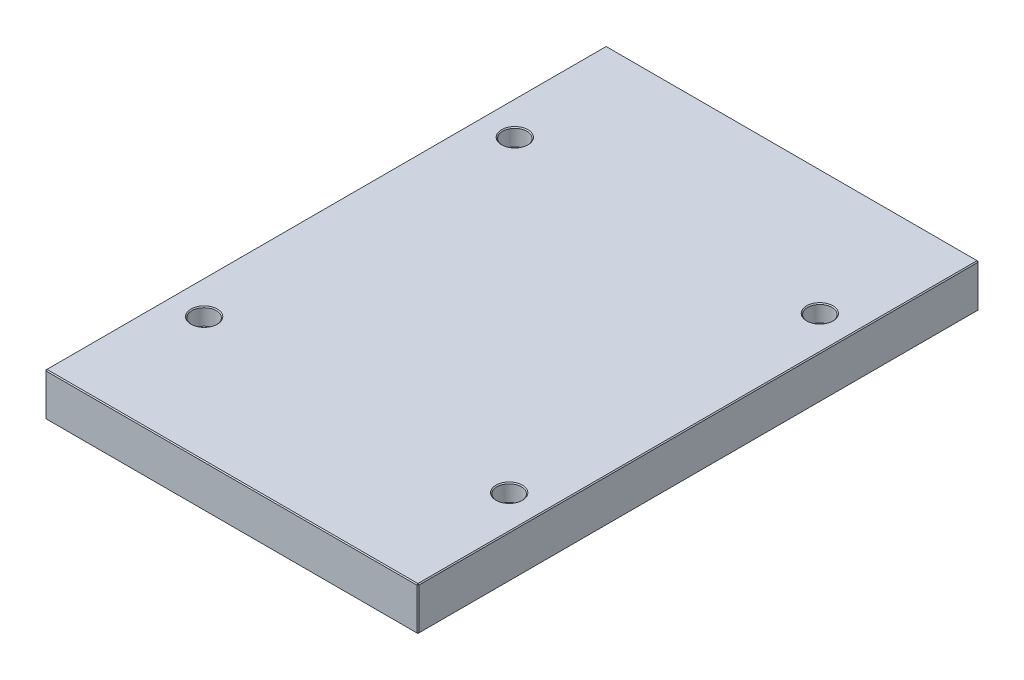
ISO-10303-21;
HEADER;
FILE_DESCRIPTION(('STEP AP214'),'2;1');
FILE_NAME('part.step','',(''),(''),'','','');
FILE_SCHEMA(('AUTOMOTIVE_DESIGN { 1 0 10303 214 1 1 1 1 }'));
ENDSEC;
DATA;
#1=APPLICATION_CONTEXT('core data for automotive mechanical design processes');
#2=APPLICATION_PROTOCOL_DEFINITION('international standard','automotive_design',2000,#1);
#3=PRODUCT_CONTEXT('',#1,'mechanical');
#4=PRODUCT('Part','Part','',(#3));
#5=PRODUCT_RELATED_PRODUCT_CATEGORY('part','',(#4));
#6=PRODUCT_DEFINITION_FORMATION('','',#4);
#7=PRODUCT_DEFINITION_CONTEXT('part definition',#1,'design');
#8=PRODUCT_DEFINITION('design','',#6,#7);
#9=PRODUCT_DEFINITION_SHAPE('','',#8);
#10=(LENGTH_UNIT() NAMED_UNIT(*) SI_UNIT(.MILLI.,.METRE.));
#11=(NAMED_UNIT(*) PLANE_ANGLE_UNIT() SI_UNIT($,.RADIAN.));
#12=(NAMED_UNIT(*) SI_UNIT($,.STERADIAN.) SOLID_ANGLE_UNIT());
#13=UNCERTAINTY_MEASURE_WITH_UNIT(LENGTH_MEASURE(1.E-05),#10,'distance_accuracy_value','');
#14=(GEOMETRIC_REPRESENTATION_CONTEXT(3) GLOBAL_UNCERTAINTY_ASSIGNED_CONTEXT((#13)) GLOBAL_UNIT_ASSIGNED_CONTEXT((#10,
#11,#12)) REPRESENTATION_CONTEXT('',''));
#15=CARTESIAN_POINT('',(0.,0.,0.));
#16=DIRECTION('',(0.,0.,1.));
#17=DIRECTION('',(1.,0.,0.));
#18=AXIS2_PLACEMENT_3D('',#15,#16,#17);
#19=CARTESIAN_POINT('',(-198.,46.,298.));
#20=DIRECTION('',(1.,0.,0.));
#21=DIRECTION('',(0.,0.,-1.));
#22=AXIS2_PLACEMENT_3D('',#19,#20,#21);
#23=PLANE('',#22);
#24=DIRECTION('',(0.,-1.,0.));
#25=VECTOR('',#24,1.);
#26=CARTESIAN_POINT('',(-198.,46.,-297.));
#27=LINE('',#26,#25);
#28=CARTESIAN_POINT('',(-198.,45.,-297.));
#29=VERTEX_POINT('',#28);
#30=CARTESIAN_POINT('',(-198.,1.00000000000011,-297.));
#31=VERTEX_POINT('',#30);
#32=EDGE_CURVE('E115',#29,#31,#27,.T.);
#33=ORIENTED_EDGE('',*,*,#32,.T.);
#34=DIRECTION('',(0.,0.,1.));
#35=VECTOR('',#34,1.);
#36=CARTESIAN_POINT('',(-198.,1.00000000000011,298.));
#37=LINE('',#36,#35);
#38=CARTESIAN_POINT('',(-198.,1.00000000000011,297.));
#39=VERTEX_POINT('',#38);
#40=EDGE_CURVE('E111',#31,#39,#37,.T.);
#41=ORIENTED_EDGE('',*,*,#40,.T.);
#42=DIRECTION('',(0.,1.,0.));
#43=VECTOR('',#42,1.);
#44=CARTESIAN_POINT('',(-198.,46.,297.));
#45=LINE('',#44,#43);
#46=CARTESIAN_POINT('',(-198.,45.,297.));
#47=VERTEX_POINT('',#46);
#48=EDGE_CURVE('E104',#39,#47,#45,.T.);
#49=ORIENTED_EDGE('',*,*,#48,.T.);
#50=DIRECTION('',(0.,0.,-1.));
#51=VECTOR('',#50,1.);
#52=CARTESIAN_POINT('',(-198.,45.,-298.));
#53=LINE('',#52,#51);
#54=EDGE_CURVE('E108',#47,#29,#53,.T.);
#55=ORIENTED_EDGE('',*,*,#54,.T.);
#56=EDGE_LOOP('',(#33,#41,#49,#55));
#57=FACE_BOUND('',#56,.T.);
#58=ADVANCED_FACE('F16',(#57),#23,.F.);
#59=CARTESIAN_POINT('',(198.,46.,298.));
#60=DIRECTION('',(0.,0.,-1.));
#61=DIRECTION('',(-1.,0.,0.));
#62=AXIS2_PLACEMENT_3D('',#59,#60,#61);
#63=PLANE('',#62);
#64=DIRECTION('',(-1.,0.,0.));
#65=VECTOR('',#64,1.);
#66=CARTESIAN_POINT('',(-198.,45.,298.));
#67=LINE('',#66,#65);
#68=CARTESIAN_POINT('',(197.,45.,298.));
#69=VERTEX_POINT('',#68);
#70=CARTESIAN_POINT('',(-197.,45.,298.));
#71=VERTEX_POINT('',#70);
#72=EDGE_CURVE('E170',#69,#71,#67,.T.);
#73=ORIENTED_EDGE('',*,*,#72,.T.);
#74=DIRECTION('',(0.,-1.,0.));
#75=VECTOR('',#74,1.);
#76=CARTESIAN_POINT('',(-197.,46.,298.));
#77=LINE('',#76,#75);
#78=CARTESIAN_POINT('',(-197.,1.00000000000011,298.));
#79=VERTEX_POINT('',#78);
#80=EDGE_CURVE('E123',#71,#79,#77,.T.);
#81=ORIENTED_EDGE('',*,*,#80,.T.);
#82=DIRECTION('',(1.,0.,0.));
#83=VECTOR('',#82,1.);
#84=CARTESIAN_POINT('',(198.,1.00000000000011,298.));
#85=LINE('',#84,#83);
#86=CARTESIAN_POINT('',(197.,1.00000000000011,298.));
#87=VERTEX_POINT('',#86);
#88=EDGE_CURVE('E174',#79,#87,#85,.T.);
#89=ORIENTED_EDGE('',*,*,#88,.T.);
#90=DIRECTION('',(0.,1.,0.));
#91=VECTOR('',#90,1.);
#92=CARTESIAN_POINT('',(197.,46.,298.));
#93=LINE('',#92,#91);
#94=EDGE_CURVE('E172',#87,#69,#93,.T.);
#95=ORIENTED_EDGE('',*,*,#94,.T.);
#96=EDGE_LOOP('',(#73,#81,#89,#95));
#97=FACE_BOUND('',#96,.T.);
#98=ADVANCED_FACE('F317',(#97),#63,.F.);
#99=CARTESIAN_POINT('',(198.,46.,298.));
#100=DIRECTION('',(-1.,0.,0.));
#101=DIRECTION('',(0.,0.,1.));
#102=AXIS2_PLACEMENT_3D('',#99,#100,#101);
#103=PLANE('',#102);
#104=DIRECTION('',(0.,0.,-1.));
#105=VECTOR('',#104,1.);
#106=CARTESIAN_POINT('',(198.,1.00000000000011,298.));
#107=LINE('',#106,#105);
#108=CARTESIAN_POINT('',(198.,1.00000000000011,297.));
#109=VERTEX_POINT('',#108);
#110=CARTESIAN_POINT('',(198.,1.00000000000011,-297.));
#111=VERTEX_POINT('',#110);
#112=EDGE_CURVE('E165',#109,#111,#107,.T.);
#113=ORIENTED_EDGE('',*,*,#112,.T.);
#114=DIRECTION('',(0.,1.,0.));
#115=VECTOR('',#114,1.);
#116=CARTESIAN_POINT('',(198.,46.,-297.));
#117=LINE('',#116,#115);
#118=CARTESIAN_POINT('',(198.,45.,-297.));
#119=VERTEX_POINT('',#118);
#120=EDGE_CURVE('E167',#111,#119,#117,.T.);
#121=ORIENTED_EDGE('',*,*,#120,.T.);
#122=DIRECTION('',(0.,0.,1.));
#123=VECTOR('',#122,1.);
#124=CARTESIAN_POINT('',(198.,45.,298.));
#125=LINE('',#124,#123);
#126=CARTESIAN_POINT('',(198.,45.,297.));
#127=VERTEX_POINT('',#126);
#128=EDGE_CURVE('E161',#119,#127,#125,.T.);
#129=ORIENTED_EDGE('',*,*,#128,.T.);
#130=DIRECTION('',(0.,-1.,0.));
#131=VECTOR('',#130,1.);
#132=CARTESIAN_POINT('',(198.,46.,297.));
#133=LINE('',#132,#131);
#134=EDGE_CURVE('E163',#127,#109,#133,.T.);
#135=ORIENTED_EDGE('',*,*,#134,.T.);
#136=EDGE_LOOP('',(#113,#121,#129,#135));
#137=FACE_BOUND('',#136,.T.);
#138=ADVANCED_FACE('F323',(#137),#103,.F.);
#139=CARTESIAN_POINT('',(198.,46.,-298.));
#140=DIRECTION('',(0.,0.,1.));
#141=DIRECTION('',(1.,0.,0.));
#142=AXIS2_PLACEMENT_3D('',#139,#140,#141);
#143=PLANE('',#142);
#144=DIRECTION('',(0.,-1.,0.));
#145=VECTOR('',#144,1.);
#146=CARTESIAN_POINT('',(197.,46.,-298.));
#147=LINE('',#146,#145);
#148=CARTESIAN_POINT('',(197.,45.,-298.));
#149=VERTEX_POINT('',#148);
#150=CARTESIAN_POINT('',(197.,1.00000000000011,-298.));
#151=VERTEX_POINT('',#150);
#152=EDGE_CURVE('E154',#149,#151,#147,.T.);
#153=ORIENTED_EDGE('',*,*,#152,.T.);
#154=DIRECTION('',(-1.,0.,0.));
#155=VECTOR('',#154,1.);
#156=CARTESIAN_POINT('',(198.,1.00000000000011,-298.));
#157=LINE('',#156,#155);
#158=CARTESIAN_POINT('',(-197.,1.00000000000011,-298.));
#159=VERTEX_POINT('',#158);
#160=EDGE_CURVE('E159',#151,#159,#157,.T.);
#161=ORIENTED_EDGE('',*,*,#160,.T.);
#162=DIRECTION('',(0.,1.,0.));
#163=VECTOR('',#162,1.);
#164=CARTESIAN_POINT('',(-197.,46.,-298.));
#165=LINE('',#164,#163);
#166=CARTESIAN_POINT('',(-197.,45.,-298.));
#167=VERTEX_POINT('',#166);
#168=EDGE_CURVE('E156',#159,#167,#165,.T.);
#169=ORIENTED_EDGE('',*,*,#168,.T.);
#170=DIRECTION('',(1.,0.,0.));
#171=VECTOR('',#170,1.);
#172=CARTESIAN_POINT('',(198.,45.,-298.));
#173=LINE('',#172,#171);
#174=EDGE_CURVE('E152',#167,#149,#173,.T.);
#175=ORIENTED_EDGE('',*,*,#174,.T.);
#176=EDGE_LOOP('',(#153,#161,#169,#175));
#177=FACE_BOUND('',#176,.T.);
#178=ADVANCED_FACE('F465',(#177),#143,.F.);
#179=CARTESIAN_POINT('',(0.,46.,0.));
#180=DIRECTION('',(0.,1.,0.));
#181=DIRECTION('',(0.,0.,1.));
#182=AXIS2_PLACEMENT_3D('',#179,#180,#181);
#183=PLANE('',#182);
#184=CARTESIAN_POINT('',(-162.,46.,165.));
#185=DIRECTION('',(0.,1.,0.));
#186=DIRECTION('',(0.,0.,1.));
#187=AXIS2_PLACEMENT_3D('',#184,#185,#186);
#188=CIRCLE('',#187,14.);
#189=CARTESIAN_POINT('',(-162.,46.,179.));
#190=VERTEX_POINT('',#189);
#191=EDGE_CURVE('E290',#190,#190,#188,.F.);
#192=ORIENTED_EDGE('',*,*,#191,.T.);
#193=EDGE_LOOP('',(#192));
#194=FACE_BOUND('',#193,.T.);
#195=CARTESIAN_POINT('',(162.,46.,165.));
#196=DIRECTION('',(0.,1.,0.));
#197=DIRECTION('',(0.,0.,1.));
#198=AXIS2_PLACEMENT_3D('',#195,#196,#197);
#199=CIRCLE('',#198,14.);
#200=CARTESIAN_POINT('',(162.,46.,179.));
#201=VERTEX_POINT('',#200);
#202=EDGE_CURVE('E287',#201,#201,#199,.F.);
#203=ORIENTED_EDGE('',*,*,#202,.T.);
#204=EDGE_LOOP('',(#203));
#205=FACE_BOUND('',#204,.T.);
#206=CARTESIAN_POINT('',(162.,46.,-165.));
#207=DIRECTION('',(0.,1.,0.));
#208=DIRECTION('',(0.,0.,1.));
#209=AXIS2_PLACEMENT_3D('',#206,#207,#208);
#210=CIRCLE('',#209,14.);
#211=CARTESIAN_POINT('',(162.,46.,-151.));
#212=VERTEX_POINT('',#211);
#213=EDGE_CURVE('E284',#212,#212,#210,.F.);
#214=ORIENTED_EDGE('',*,*,#213,.T.);
#215=EDGE_LOOP('',(#214));
#216=FACE_BOUND('',#215,.T.);
#217=CARTESIAN_POINT('',(-162.,46.,-165.));
#218=DIRECTION('',(0.,1.,0.));
#219=DIRECTION('',(0.,0.,1.));
#220=AXIS2_PLACEMENT_3D('',#217,#218,#219);
#221=CIRCLE('',#220,14.);
#222=CARTESIAN_POINT('',(-162.,46.,-151.));
#223=VERTEX_POINT('',#222);
#224=EDGE_CURVE('E281',#223,#223,#221,.F.);
#225=ORIENTED_EDGE('',*,*,#224,.T.);
#226=EDGE_LOOP('',(#225));
#227=FACE_BOUND('',#226,.T.);
#228=DIRECTION('',(0.,0.,-1.));
#229=VECTOR('',#228,1.);
#230=CARTESIAN_POINT('',(197.,46.,-298.));
#231=LINE('',#230,#229);
#232=CARTESIAN_POINT('',(197.,46.,297.));
#233=VERTEX_POINT('',#232);
#234=CARTESIAN_POINT('',(197.,46.,-297.));
#235=VERTEX_POINT('',#234);
#236=EDGE_CURVE('E31',#233,#235,#231,.T.);
#237=ORIENTED_EDGE('',*,*,#236,.T.);
#238=DIRECTION('',(-1.,0.,0.));
#239=VECTOR('',#238,1.);
#240=CARTESIAN_POINT('',(-198.,46.,-297.));
#241=LINE('',#240,#239);
#242=CARTESIAN_POINT('',(-197.,46.,-297.));
#243=VERTEX_POINT('',#242);
#244=EDGE_CURVE('E190',#235,#243,#241,.T.);
#245=ORIENTED_EDGE('',*,*,#244,.T.);
#246=DIRECTION('',(0.,0.,1.));
#247=VECTOR('',#246,1.);
#248=CARTESIAN_POINT('',(-197.,46.,298.));
#249=LINE('',#248,#247);
#250=CARTESIAN_POINT('',(-197.,46.,297.));
#251=VERTEX_POINT('',#250);
#252=EDGE_CURVE('E186',#243,#251,#249,.T.);
#253=ORIENTED_EDGE('',*,*,#252,.T.);
#254=DIRECTION('',(1.,0.,0.));
#255=VECTOR('',#254,1.);
#256=CARTESIAN_POINT('',(198.,46.,297.));
#257=LINE('',#256,#255);
#258=EDGE_CURVE('E36',#251,#233,#257,.T.);
#259=ORIENTED_EDGE('',*,*,#258,.T.);
#260=EDGE_LOOP('',(#237,#245,#253,#259));
#261=FACE_BOUND('',#260,.T.);
#262=ADVANCED_FACE('F462',(#194,#205,#216,#227,#261),#183,.T.);
#263=CARTESIAN_POINT('',(0.,0.,0.));
#264=DIRECTION('',(0.,1.,0.));
#265=DIRECTION('',(0.,0.,1.));
#266=AXIS2_PLACEMENT_3D('',#263,#264,#265);
#267=PLANE('',#266);
#268=CARTESIAN_POINT('',(162.,0.,-165.));
#269=DIRECTION('',(0.,1.,0.));
#270=DIRECTION('',(0.,0.,1.));
#271=AXIS2_PLACEMENT_3D('',#268,#269,#270);
#272=CIRCLE('',#271,10.0000000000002);
#273=CARTESIAN_POINT('',(162.,0.,-155.));
#274=VERTEX_POINT('',#273);
#275=EDGE_CURVE('E263',#274,#274,#272,.T.);
#276=ORIENTED_EDGE('',*,*,#275,.T.);
#277=EDGE_LOOP('',(#276));
#278=FACE_BOUND('',#277,.T.);
#279=CARTESIAN_POINT('',(162.,0.,165.));
#280=DIRECTION('',(0.,1.,0.));
#281=DIRECTION('',(0.,0.,1.));
#282=AXIS2_PLACEMENT_3D('',#279,#280,#281);
#283=CIRCLE('',#282,10.0000000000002);
#284=CARTESIAN_POINT('',(162.,0.,175.));
#285=VERTEX_POINT('',#284);
#286=EDGE_CURVE('E260',#285,#285,#283,.T.);
#287=ORIENTED_EDGE('',*,*,#286,.T.);
#288=EDGE_LOOP('',(#287));
#289=FACE_BOUND('',#288,.T.);
#290=CARTESIAN_POINT('',(-162.,0.,165.));
#291=DIRECTION('',(0.,1.,0.));
#292=DIRECTION('',(0.,0.,1.));
#293=AXIS2_PLACEMENT_3D('',#290,#291,#292);
#294=CIRCLE('',#293,10.0000000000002);
#295=CARTESIAN_POINT('',(-162.,0.,175.));
#296=VERTEX_POINT('',#295);
#297=EDGE_CURVE('E257',#296,#296,#294,.T.);
#298=ORIENTED_EDGE('',*,*,#297,.T.);
#299=EDGE_LOOP('',(#298));
#300=FACE_BOUND('',#299,.T.);
#301=CARTESIAN_POINT('',(-162.,0.,-165.));
#302=DIRECTION('',(0.,1.,0.));
#303=DIRECTION('',(0.,0.,1.));
#304=AXIS2_PLACEMENT_3D('',#301,#302,#303);
#305=CIRCLE('',#304,10.0000000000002);
#306=CARTESIAN_POINT('',(-162.,0.,-155.));
#307=VERTEX_POINT('',#306);
#308=EDGE_CURVE('E192',#307,#307,#305,.T.);
#309=ORIENTED_EDGE('',*,*,#308,.T.);
#310=EDGE_LOOP('',(#309));
#311=FACE_BOUND('',#310,.T.);
#312=DIRECTION('',(0.,0.,1.));
#313=VECTOR('',#312,1.);
#314=CARTESIAN_POINT('',(197.,0.,0.));
#315=LINE('',#314,#313);
#316=CARTESIAN_POINT('',(197.,0.,-297.));
#317=VERTEX_POINT('',#316);
#318=CARTESIAN_POINT('',(197.,0.,297.));
#319=VERTEX_POINT('',#318);
#320=EDGE_CURVE('E177',#317,#319,#315,.T.);
#321=ORIENTED_EDGE('',*,*,#320,.T.);
#322=DIRECTION('',(-1.,0.,0.));
#323=VECTOR('',#322,1.);
#324=CARTESIAN_POINT('',(0.,0.,297.));
#325=LINE('',#324,#323);
#326=CARTESIAN_POINT('',(-197.,0.,297.));
#327=VERTEX_POINT('',#326);
#328=EDGE_CURVE('E183',#319,#327,#325,.T.);
#329=ORIENTED_EDGE('',*,*,#328,.T.);
#330=DIRECTION('',(0.,0.,-1.));
#331=VECTOR('',#330,1.);
#332=CARTESIAN_POINT('',(-197.,0.,0.));
#333=LINE('',#332,#331);
#334=CARTESIAN_POINT('',(-197.,0.,-297.));
#335=VERTEX_POINT('',#334);
#336=EDGE_CURVE('E181',#327,#335,#333,.T.);
#337=ORIENTED_EDGE('',*,*,#336,.T.);
#338=DIRECTION('',(1.,0.,0.));
#339=VECTOR('',#338,1.);
#340=CARTESIAN_POINT('',(0.,0.,-297.));
#341=LINE('',#340,#339);
#342=EDGE_CURVE('E179',#335,#317,#341,.T.);
#343=ORIENTED_EDGE('',*,*,#342,.T.);
#344=EDGE_LOOP('',(#321,#329,#337,#343));
#345=FACE_BOUND('',#344,.T.);
#346=ADVANCED_FACE('F402',(#278,#289,#300,#311,#345),#267,.F.);
#347=CARTESIAN_POINT('',(198.,46.,297.));
#348=DIRECTION('',(-0.707106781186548,0.,-0.707106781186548));
#349=DIRECTION('',(0.,-1.,0.));
#350=AXIS2_PLACEMENT_3D('',#347,#348,#349);
#351=PLANE('',#350);
#352=DIRECTION('',(-0.707106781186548,0.,0.707106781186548));
#353=VECTOR('',#352,1.);
#354=CARTESIAN_POINT('',(197.,45.,298.));
#355=LINE('',#354,#353);
#356=EDGE_CURVE('E141',#69,#127,#355,.F.);
#357=ORIENTED_EDGE('',*,*,#356,.F.);
#358=ORIENTED_EDGE('',*,*,#94,.F.);
#359=DIRECTION('',(0.707106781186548,0.,-0.707106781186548));
#360=VECTOR('',#359,1.);
#361=CARTESIAN_POINT('',(197.,1.00000000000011,298.));
#362=LINE('',#361,#360);
#363=EDGE_CURVE('E144',#109,#87,#362,.F.);
#364=ORIENTED_EDGE('',*,*,#363,.F.);
#365=ORIENTED_EDGE('',*,*,#134,.F.);
#366=EDGE_LOOP('',(#357,#358,#364,#365));
#367=FACE_BOUND('',#366,.T.);
#368=ADVANCED_FACE('F398',(#367),#351,.F.);
#369=CARTESIAN_POINT('',(197.,45.,298.));
#370=DIRECTION('',(0.577350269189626,0.577350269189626,0.577350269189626));
#371=DIRECTION('',(0.707106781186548,0.,-0.707106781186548));
#372=AXIS2_PLACEMENT_3D('',#369,#370,#371);
#373=PLANE('',#372);
#374=DIRECTION('',(0.,-0.707106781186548,0.707106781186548));
#375=VECTOR('',#374,1.);
#376=CARTESIAN_POINT('',(197.,45.,298.));
#377=LINE('',#376,#375);
#378=EDGE_CURVE('E235',#69,#233,#377,.F.);
#379=ORIENTED_EDGE('',*,*,#378,.F.);
#380=ORIENTED_EDGE('',*,*,#356,.T.);
#381=DIRECTION('',(-0.707106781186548,0.707106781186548,0.));
#382=VECTOR('',#381,1.);
#383=CARTESIAN_POINT('',(197.5,45.5,297.));
#384=LINE('',#383,#382);
#385=EDGE_CURVE('E237',#233,#127,#384,.F.);
#386=ORIENTED_EDGE('',*,*,#385,.F.);
#387=EDGE_LOOP('',(#379,#380,#386));
#388=FACE_BOUND('',#387,.T.);
#389=ADVANCED_FACE('F394',(#388),#373,.T.);
#390=CARTESIAN_POINT('',(197.,1.00000000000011,298.));
#391=DIRECTION('',(0.577350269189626,-0.577350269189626,0.577350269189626));
#392=DIRECTION('',(0.707106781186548,0.,-0.707106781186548));
#393=AXIS2_PLACEMENT_3D('',#390,#391,#392);
#394=PLANE('',#393);
#395=DIRECTION('',(-0.707106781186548,-0.707106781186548,0.));
#396=VECTOR('',#395,1.);
#397=CARTESIAN_POINT('',(197.5,0.500000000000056,297.));
#398=LINE('',#397,#396);
#399=EDGE_CURVE('E229',#109,#319,#398,.T.);
#400=ORIENTED_EDGE('',*,*,#399,.F.);
#401=ORIENTED_EDGE('',*,*,#363,.T.);
#402=DIRECTION('',(0.,0.707106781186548,0.707106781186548));
#403=VECTOR('',#402,1.);
#404=CARTESIAN_POINT('',(197.,1.00000000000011,298.));
#405=LINE('',#404,#403);
#406=EDGE_CURVE('E232',#319,#87,#405,.T.);
#407=ORIENTED_EDGE('',*,*,#406,.F.);
#408=EDGE_LOOP('',(#400,#401,#407));
#409=FACE_BOUND('',#408,.T.);
#410=ADVANCED_FACE('F390',(#409),#394,.T.);
#411=CARTESIAN_POINT('',(197.,46.,0.));
#412=DIRECTION('',(0.707106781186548,0.707106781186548,0.));
#413=DIRECTION('',(0.,0.,1.));
#414=AXIS2_PLACEMENT_3D('',#411,#412,#413);
#415=PLANE('',#414);
#416=ORIENTED_EDGE('',*,*,#385,.T.);
#417=ORIENTED_EDGE('',*,*,#128,.F.);
#418=DIRECTION('',(0.707106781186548,-0.707106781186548,0.));
#419=VECTOR('',#418,1.);
#420=CARTESIAN_POINT('',(198.,45.,-297.));
#421=LINE('',#420,#419);
#422=EDGE_CURVE('E224',#235,#119,#421,.T.);
#423=ORIENTED_EDGE('',*,*,#422,.F.);
#424=ORIENTED_EDGE('',*,*,#236,.F.);
#425=EDGE_LOOP('',(#416,#417,#423,#424));
#426=FACE_BOUND('',#425,.T.);
#427=ADVANCED_FACE('F386',(#426),#415,.T.);
#428=CARTESIAN_POINT('',(0.,46.,297.));
#429=DIRECTION('',(0.,0.707106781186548,0.707106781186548));
#430=DIRECTION('',(-1.,0.,0.));
#431=AXIS2_PLACEMENT_3D('',#428,#429,#430);
#432=PLANE('',#431);
#433=ORIENTED_EDGE('',*,*,#378,.T.);
#434=ORIENTED_EDGE('',*,*,#258,.F.);
#435=DIRECTION('',(0.,0.707106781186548,-0.707106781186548));
#436=VECTOR('',#435,1.);
#437=CARTESIAN_POINT('',(-197.,45.5,297.5));
#438=LINE('',#437,#436);
#439=EDGE_CURVE('E127',#71,#251,#438,.T.);
#440=ORIENTED_EDGE('',*,*,#439,.F.);
#441=ORIENTED_EDGE('',*,*,#72,.F.);
#442=EDGE_LOOP('',(#433,#434,#440,#441));
#443=FACE_BOUND('',#442,.T.);
#444=ADVANCED_FACE('F383',(#443),#432,.T.);
#445=CARTESIAN_POINT('',(-197.,46.,298.));
#446=DIRECTION('',(0.707106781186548,0.,-0.707106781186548));
#447=DIRECTION('',(0.,-1.,0.));
#448=AXIS2_PLACEMENT_3D('',#445,#446,#447);
#449=PLANE('',#448);
#450=DIRECTION('',(0.707106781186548,0.,0.707106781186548));
#451=VECTOR('',#450,1.);
#452=CARTESIAN_POINT('',(-197.,1.00000000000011,298.));
#453=LINE('',#452,#451);
#454=EDGE_CURVE('E128',#79,#39,#453,.F.);
#455=ORIENTED_EDGE('',*,*,#454,.F.);
#456=ORIENTED_EDGE('',*,*,#80,.F.);
#457=DIRECTION('',(-0.707106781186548,0.,-0.707106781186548));
#458=VECTOR('',#457,1.);
#459=CARTESIAN_POINT('',(-198.,45.,297.));
#460=LINE('',#459,#458);
#461=EDGE_CURVE('E119',#47,#71,#460,.F.);
#462=ORIENTED_EDGE('',*,*,#461,.F.);
#463=ORIENTED_EDGE('',*,*,#48,.F.);
#464=EDGE_LOOP('',(#455,#456,#462,#463));
#465=FACE_BOUND('',#464,.T.);
#466=ADVANCED_FACE('F121',(#465),#449,.F.);
#467=CARTESIAN_POINT('',(198.,1.00000000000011,298.));
#468=DIRECTION('',(0.,0.707106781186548,-0.707106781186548));
#469=DIRECTION('',(1.,0.,0.));
#470=AXIS2_PLACEMENT_3D('',#467,#468,#469);
#471=PLANE('',#470);
#472=ORIENTED_EDGE('',*,*,#406,.T.);
#473=ORIENTED_EDGE('',*,*,#88,.F.);
#474=DIRECTION('',(0.,-0.707106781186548,-0.707106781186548));
#475=VECTOR('',#474,1.);
#476=CARTESIAN_POINT('',(-197.,1.00000000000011,298.));
#477=LINE('',#476,#475);
#478=EDGE_CURVE('E220',#327,#79,#477,.F.);
#479=ORIENTED_EDGE('',*,*,#478,.F.);
#480=ORIENTED_EDGE('',*,*,#328,.F.);
#481=EDGE_LOOP('',(#472,#473,#479,#480));
#482=FACE_BOUND('',#481,.T.);
#483=ADVANCED_FACE('F376',(#482),#471,.F.);
#484=CARTESIAN_POINT('',(198.,1.00000000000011,298.));
#485=DIRECTION('',(-0.707106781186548,0.707106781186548,0.));
#486=DIRECTION('',(0.,0.,-1.));
#487=AXIS2_PLACEMENT_3D('',#484,#485,#486);
#488=PLANE('',#487);
#489=ORIENTED_EDGE('',*,*,#399,.T.);
#490=ORIENTED_EDGE('',*,*,#320,.F.);
#491=DIRECTION('',(0.707106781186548,0.707106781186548,-1.17583651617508E-13));
#492=VECTOR('',#491,1.);
#493=CARTESIAN_POINT('',(197.5,0.500000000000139,-297.));
#494=LINE('',#493,#492);
#495=EDGE_CURVE('E217',#111,#317,#494,.F.);
#496=ORIENTED_EDGE('',*,*,#495,.F.);
#497=ORIENTED_EDGE('',*,*,#112,.F.);
#498=EDGE_LOOP('',(#489,#490,#496,#497));
#499=FACE_BOUND('',#498,.T.);
#500=ADVANCED_FACE('F372',(#499),#488,.F.);
#501=CARTESIAN_POINT('',(197.,46.,-298.));
#502=DIRECTION('',(-0.707106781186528,0.,0.707106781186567));
#503=DIRECTION('',(0.,-1.,0.));
#504=AXIS2_PLACEMENT_3D('',#501,#502,#503);
#505=PLANE('',#504);
#506=DIRECTION('',(0.707106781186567,0.,0.707106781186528));
#507=VECTOR('',#506,1.);
#508=CARTESIAN_POINT('',(198.,45.,-297.));
#509=LINE('',#508,#507);
#510=EDGE_CURVE('E226',#119,#149,#509,.F.);
#511=ORIENTED_EDGE('',*,*,#510,.F.);
#512=ORIENTED_EDGE('',*,*,#120,.F.);
#513=DIRECTION('',(-0.707106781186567,0.,-0.707106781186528));
#514=VECTOR('',#513,1.);
#515=CARTESIAN_POINT('',(197.,1.00000000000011,-298.));
#516=LINE('',#515,#514);
#517=EDGE_CURVE('E214',#151,#111,#516,.F.);
#518=ORIENTED_EDGE('',*,*,#517,.F.);
#519=ORIENTED_EDGE('',*,*,#152,.F.);
#520=EDGE_LOOP('',(#511,#512,#518,#519));
#521=FACE_BOUND('',#520,.T.);
#522=ADVANCED_FACE('F368',(#521),#505,.F.);
#523=CARTESIAN_POINT('',(198.,45.,-297.));
#524=DIRECTION('',(0.577350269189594,0.577350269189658,-0.577350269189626));
#525=DIRECTION('',(0.,0.707106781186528,0.707106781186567));
#526=AXIS2_PLACEMENT_3D('',#523,#524,#525);
#527=PLANE('',#526);
#528=ORIENTED_EDGE('',*,*,#422,.T.);
#529=ORIENTED_EDGE('',*,*,#510,.T.);
#530=DIRECTION('',(0.,0.707106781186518,0.707106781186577));
#531=VECTOR('',#530,1.);
#532=CARTESIAN_POINT('',(197.,45.5,-297.5));
#533=LINE('',#532,#531);
#534=EDGE_CURVE('E135',#235,#149,#533,.F.);
#535=ORIENTED_EDGE('',*,*,#534,.F.);
#536=EDGE_LOOP('',(#528,#529,#535));
#537=FACE_BOUND('',#536,.T.);
#538=ADVANCED_FACE('F365',(#537),#527,.T.);
#539=CARTESIAN_POINT('',(-198.,45.,297.));
#540=DIRECTION('',(-0.577350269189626,0.577350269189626,0.577350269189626));
#541=DIRECTION('',(0.707106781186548,0.,0.707106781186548));
#542=AXIS2_PLACEMENT_3D('',#539,#540,#541);
#543=PLANE('',#542);
#544=ORIENTED_EDGE('',*,*,#461,.T.);
#545=ORIENTED_EDGE('',*,*,#439,.T.);
#546=DIRECTION('',(-0.707106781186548,-0.707106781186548,0.));
#547=VECTOR('',#546,1.);
#548=CARTESIAN_POINT('',(-198.,45.,297.));
#549=LINE('',#548,#547);
#550=EDGE_CURVE('E131',#47,#251,#549,.F.);
#551=ORIENTED_EDGE('',*,*,#550,.F.);
#552=EDGE_LOOP('',(#544,#545,#551));
#553=FACE_BOUND('',#552,.T.);
#554=ADVANCED_FACE('F132',(#553),#543,.T.);
#555=CARTESIAN_POINT('',(-197.,1.00000000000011,298.));
#556=DIRECTION('',(-0.577350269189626,-0.577350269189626,0.577350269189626));
#557=DIRECTION('',(0.707106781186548,0.,0.707106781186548));
#558=AXIS2_PLACEMENT_3D('',#555,#556,#557);
#559=PLANE('',#558);
#560=ORIENTED_EDGE('',*,*,#478,.T.);
#561=ORIENTED_EDGE('',*,*,#454,.T.);
#562=DIRECTION('',(-0.707106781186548,0.707106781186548,0.));
#563=VECTOR('',#562,1.);
#564=CARTESIAN_POINT('',(-197.5,0.500000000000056,297.));
#565=LINE('',#564,#563);
#566=EDGE_CURVE('E136',#327,#39,#565,.T.);
#567=ORIENTED_EDGE('',*,*,#566,.F.);
#568=EDGE_LOOP('',(#560,#561,#567));
#569=FACE_BOUND('',#568,.T.);
#570=ADVANCED_FACE('F358',(#569),#559,.T.);
#571=CARTESIAN_POINT('',(197.,1.00000000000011,-298.));
#572=DIRECTION('',(0.577350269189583,-0.577350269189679,-0.577350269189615));
#573=DIRECTION('',(0.,0.707106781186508,-0.707106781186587));
#574=AXIS2_PLACEMENT_3D('',#571,#572,#573);
#575=PLANE('',#574);
#576=ORIENTED_EDGE('',*,*,#517,.T.);
#577=ORIENTED_EDGE('',*,*,#495,.T.);
#578=DIRECTION('',(0.,-0.707106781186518,0.707106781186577));
#579=VECTOR('',#578,1.);
#580=CARTESIAN_POINT('',(197.,1.00000000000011,-298.));
#581=LINE('',#580,#579);
#582=EDGE_CURVE('E207',#151,#317,#581,.T.);
#583=ORIENTED_EDGE('',*,*,#582,.F.);
#584=EDGE_LOOP('',(#576,#577,#583));
#585=FACE_BOUND('',#584,.T.);
#586=ADVANCED_FACE('F354',(#585),#575,.T.);
#587=CARTESIAN_POINT('',(0.,46.,-297.));
#588=DIRECTION('',(0.,0.707106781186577,-0.707106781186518));
#589=DIRECTION('',(1.,0.,0.));
#590=AXIS2_PLACEMENT_3D('',#587,#588,#589);
#591=PLANE('',#590);
#592=ORIENTED_EDGE('',*,*,#534,.T.);
#593=ORIENTED_EDGE('',*,*,#174,.F.);
#594=DIRECTION('',(0.,-0.707106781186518,-0.707106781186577));
#595=VECTOR('',#594,1.);
#596=CARTESIAN_POINT('',(-197.,45.,-298.));
#597=LINE('',#596,#595);
#598=EDGE_CURVE('E204',#243,#167,#597,.T.);
#599=ORIENTED_EDGE('',*,*,#598,.F.);
#600=ORIENTED_EDGE('',*,*,#244,.F.);
#601=EDGE_LOOP('',(#592,#593,#599,#600));
#602=FACE_BOUND('',#601,.T.);
#603=ADVANCED_FACE('F351',(#602),#591,.T.);
#604=CARTESIAN_POINT('',(-197.,46.,0.));
#605=DIRECTION('',(-0.707106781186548,0.707106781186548,0.));
#606=DIRECTION('',(0.,0.,-1.));
#607=AXIS2_PLACEMENT_3D('',#604,#605,#606);
#608=PLANE('',#607);
#609=ORIENTED_EDGE('',*,*,#550,.T.);
#610=ORIENTED_EDGE('',*,*,#252,.F.);
#611=DIRECTION('',(0.707106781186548,0.707106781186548,1.17767360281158E-13));
#612=VECTOR('',#611,1.);
#613=CARTESIAN_POINT('',(-197.5,45.5,-297.));
#614=LINE('',#613,#612);
#615=EDGE_CURVE('E139',#29,#243,#614,.T.);
#616=ORIENTED_EDGE('',*,*,#615,.F.);
#617=ORIENTED_EDGE('',*,*,#54,.F.);
#618=EDGE_LOOP('',(#609,#610,#616,#617));
#619=FACE_BOUND('',#618,.T.);
#620=ADVANCED_FACE('F138',(#619),#608,.T.);
#621=CARTESIAN_POINT('',(-198.,1.00000000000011,298.));
#622=DIRECTION('',(0.707106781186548,0.707106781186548,0.));
#623=DIRECTION('',(0.,0.,1.));
#624=AXIS2_PLACEMENT_3D('',#621,#622,#623);
#625=PLANE('',#624);
#626=ORIENTED_EDGE('',*,*,#566,.T.);
#627=ORIENTED_EDGE('',*,*,#40,.F.);
#628=DIRECTION('',(0.707106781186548,-0.707106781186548,1.57203993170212E-13));
#629=VECTOR('',#628,1.);
#630=CARTESIAN_POINT('',(-198.,1.00000000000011,-297.));
#631=LINE('',#630,#629);
#632=EDGE_CURVE('E200',#335,#31,#631,.F.);
#633=ORIENTED_EDGE('',*,*,#632,.F.);
#634=ORIENTED_EDGE('',*,*,#336,.F.);
#635=EDGE_LOOP('',(#626,#627,#633,#634));
#636=FACE_BOUND('',#635,.T.);
#637=ADVANCED_FACE('F344',(#636),#625,.F.);
#638=CARTESIAN_POINT('',(198.,1.00000000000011,-298.));
#639=DIRECTION('',(0.,0.707106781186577,0.707106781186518));
#640=DIRECTION('',(-1.,0.,0.));
#641=AXIS2_PLACEMENT_3D('',#638,#639,#640);
#642=PLANE('',#641);
#643=ORIENTED_EDGE('',*,*,#582,.T.);
#644=ORIENTED_EDGE('',*,*,#342,.F.);
#645=DIRECTION('',(0.,0.707106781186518,-0.707106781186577));
#646=VECTOR('',#645,1.);
#647=CARTESIAN_POINT('',(-197.,0.500000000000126,-297.5));
#648=LINE('',#647,#646);
#649=EDGE_CURVE('E197',#159,#335,#648,.F.);
#650=ORIENTED_EDGE('',*,*,#649,.F.);
#651=ORIENTED_EDGE('',*,*,#160,.F.);
#652=EDGE_LOOP('',(#643,#644,#650,#651));
#653=FACE_BOUND('',#652,.T.);
#654=ADVANCED_FACE('F340',(#653),#642,.F.);
#655=CARTESIAN_POINT('',(-197.,45.,-298.));
#656=DIRECTION('',(-0.577350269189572,0.577350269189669,-0.577350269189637));
#657=DIRECTION('',(0.,0.707106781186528,0.707106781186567));
#658=AXIS2_PLACEMENT_3D('',#655,#656,#657);
#659=PLANE('',#658);
#660=ORIENTED_EDGE('',*,*,#615,.T.);
#661=ORIENTED_EDGE('',*,*,#598,.T.);
#662=DIRECTION('',(0.707106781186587,0.,-0.707106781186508));
#663=VECTOR('',#662,1.);
#664=CARTESIAN_POINT('',(-197.,45.,-298.));
#665=LINE('',#664,#663);
#666=EDGE_CURVE('E195',#29,#167,#665,.T.);
#667=ORIENTED_EDGE('',*,*,#666,.F.);
#668=EDGE_LOOP('',(#660,#661,#667));
#669=FACE_BOUND('',#668,.T.);
#670=ADVANCED_FACE('F336',(#669),#659,.T.);
#671=CARTESIAN_POINT('',(-198.,1.00000000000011,-297.));
#672=DIRECTION('',(-0.577350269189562,-0.57735026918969,-0.577350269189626));
#673=DIRECTION('',(0.,0.707106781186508,-0.707106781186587));
#674=AXIS2_PLACEMENT_3D('',#671,#672,#673);
#675=PLANE('',#674);
#676=ORIENTED_EDGE('',*,*,#649,.T.);
#677=ORIENTED_EDGE('',*,*,#632,.T.);
#678=DIRECTION('',(-0.707106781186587,0.,0.707106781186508));
#679=VECTOR('',#678,1.);
#680=CARTESIAN_POINT('',(-198.,1.00000000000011,-297.));
#681=LINE('',#680,#679);
#682=EDGE_CURVE('E193',#159,#31,#681,.T.);
#683=ORIENTED_EDGE('',*,*,#682,.F.);
#684=EDGE_LOOP('',(#676,#677,#683));
#685=FACE_BOUND('',#684,.T.);
#686=ADVANCED_FACE('F332',(#685),#675,.T.);
#687=CARTESIAN_POINT('',(-198.,46.,-297.));
#688=DIRECTION('',(0.707106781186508,0.,0.707106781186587));
#689=DIRECTION('',(0.,-1.,0.));
#690=AXIS2_PLACEMENT_3D('',#687,#688,#689);
#691=PLANE('',#690);
#692=ORIENTED_EDGE('',*,*,#666,.T.);
#693=ORIENTED_EDGE('',*,*,#168,.F.);
#694=ORIENTED_EDGE('',*,*,#682,.T.);
#695=ORIENTED_EDGE('',*,*,#32,.F.);
#696=EDGE_LOOP('',(#692,#693,#694,#695));
#697=FACE_BOUND('',#696,.T.);
#698=ADVANCED_FACE('F328',(#697),#691,.F.);
#699=CARTESIAN_POINT('',(-162.,28.,-165.));
#700=DIRECTION('',(0.,1.,0.));
#701=DIRECTION('',(0.,0.,1.));
#702=AXIS2_PLACEMENT_3D('',#699,#700,#701);
#703=CYLINDRICAL_SURFACE('',#702,13.);
#704=CARTESIAN_POINT('',(-162.,45.,-165.));
#705=DIRECTION('',(0.,1.,0.));
#706=DIRECTION('',(0.,0.,1.));
#707=AXIS2_PLACEMENT_3D('',#704,#705,#706);
#708=CIRCLE('',#707,13.);
#709=CARTESIAN_POINT('',(-162.,45.,-152.));
#710=VERTEX_POINT('',#709);
#711=EDGE_CURVE('E10',#710,#710,#708,.T.);
#712=ORIENTED_EDGE('',*,*,#711,.T.);
#713=EDGE_LOOP('',(#712));
#714=FACE_BOUND('',#713,.T.);
#715=CARTESIAN_POINT('',(-162.,28.,-165.));
#716=DIRECTION('',(0.,1.,0.));
#717=DIRECTION('',(0.,0.,1.));
#718=AXIS2_PLACEMENT_3D('',#715,#716,#717);
#719=CIRCLE('',#718,13.);
#720=CARTESIAN_POINT('',(-162.,28.,-152.));
#721=VERTEX_POINT('',#720);
#722=EDGE_CURVE('E147',#721,#721,#719,.T.);
#723=ORIENTED_EDGE('',*,*,#722,.F.);
#724=EDGE_LOOP('',(#723));
#725=FACE_BOUND('',#724,.T.);
#726=ADVANCED_FACE('F331',(#714,#725),#703,.F.);
#727=CARTESIAN_POINT('',(-162.,28.,-165.));
#728=DIRECTION('',(0.,1.,0.));
#729=DIRECTION('',(0.,0.,1.));
#730=AXIS2_PLACEMENT_3D('',#727,#728,#729);
#731=PLANE('',#730);
#732=CARTESIAN_POINT('',(-162.,28.,-165.));
#733=DIRECTION('',(0.,1.,0.));
#734=DIRECTION('',(0.,0.,1.));
#735=AXIS2_PLACEMENT_3D('',#732,#733,#734);
#736=CIRCLE('',#735,9.);
#737=CARTESIAN_POINT('',(-162.,28.,-156.));
#738=VERTEX_POINT('',#737);
#739=EDGE_CURVE('E251',#738,#738,#736,.T.);
#740=ORIENTED_EDGE('',*,*,#739,.F.);
#741=EDGE_LOOP('',(#740));
#742=FACE_BOUND('',#741,.T.);
#743=ORIENTED_EDGE('',*,*,#722,.T.);
#744=EDGE_LOOP('',(#743));
#745=FACE_BOUND('',#744,.T.);
#746=ADVANCED_FACE('F450',(#742,#745),#731,.T.);
#747=CARTESIAN_POINT('',(162.,28.,-165.));
#748=DIRECTION('',(0.,1.,0.));
#749=DIRECTION('',(0.,0.,1.));
#750=AXIS2_PLACEMENT_3D('',#747,#748,#749);
#751=CYLINDRICAL_SURFACE('',#750,13.);
#752=CARTESIAN_POINT('',(162.,45.,-165.));
#753=DIRECTION('',(0.,1.,0.));
#754=DIRECTION('',(0.,0.,1.));
#755=AXIS2_PLACEMENT_3D('',#752,#753,#754);
#756=CIRCLE('',#755,13.);
#757=CARTESIAN_POINT('',(162.,45.,-152.));
#758=VERTEX_POINT('',#757);
#759=EDGE_CURVE('E24',#758,#758,#756,.T.);
#760=ORIENTED_EDGE('',*,*,#759,.T.);
#761=EDGE_LOOP('',(#760));
#762=FACE_BOUND('',#761,.T.);
#763=CARTESIAN_POINT('',(162.,28.,-165.));
#764=DIRECTION('',(0.,1.,0.));
#765=DIRECTION('',(0.,0.,1.));
#766=AXIS2_PLACEMENT_3D('',#763,#764,#765);
#767=CIRCLE('',#766,13.);
#768=CARTESIAN_POINT('',(162.,28.,-152.));
#769=VERTEX_POINT('',#768);
#770=EDGE_CURVE('E441',#769,#769,#767,.T.);
#771=ORIENTED_EDGE('',*,*,#770,.F.);
#772=EDGE_LOOP('',(#771));
#773=FACE_BOUND('',#772,.T.);
#774=ADVANCED_FACE('F298',(#762,#773),#751,.F.);
#775=CARTESIAN_POINT('',(162.,28.,-165.));
#776=DIRECTION('',(0.,1.,0.));
#777=DIRECTION('',(0.,0.,1.));
#778=AXIS2_PLACEMENT_3D('',#775,#776,#777);
#779=PLANE('',#778);
#780=CARTESIAN_POINT('',(162.,28.,-165.));
#781=DIRECTION('',(0.,1.,0.));
#782=DIRECTION('',(0.,0.,1.));
#783=AXIS2_PLACEMENT_3D('',#780,#781,#782);
#784=CIRCLE('',#783,9.);
#785=CARTESIAN_POINT('',(162.,28.,-156.));
#786=VERTEX_POINT('',#785);
#787=EDGE_CURVE('E248',#786,#786,#784,.T.);
#788=ORIENTED_EDGE('',*,*,#787,.F.);
#789=EDGE_LOOP('',(#788));
#790=FACE_BOUND('',#789,.T.);
#791=ORIENTED_EDGE('',*,*,#770,.T.);
#792=EDGE_LOOP('',(#791));
#793=FACE_BOUND('',#792,.T.);
#794=ADVANCED_FACE('F738',(#790,#793),#779,.T.);
#795=CARTESIAN_POINT('',(162.,28.,165.));
#796=DIRECTION('',(0.,1.,0.));
#797=DIRECTION('',(0.,0.,1.));
#798=AXIS2_PLACEMENT_3D('',#795,#796,#797);
#799=CYLINDRICAL_SURFACE('',#798,13.);
#800=CARTESIAN_POINT('',(162.,45.,165.));
#801=DIRECTION('',(0.,1.,0.));
#802=DIRECTION('',(0.,0.,1.));
#803=AXIS2_PLACEMENT_3D('',#800,#801,#802);
#804=CIRCLE('',#803,13.);
#805=CARTESIAN_POINT('',(162.,45.,178.));
#806=VERTEX_POINT('',#805);
#807=EDGE_CURVE('E293',#806,#806,#804,.T.);
#808=ORIENTED_EDGE('',*,*,#807,.T.);
#809=EDGE_LOOP('',(#808));
#810=FACE_BOUND('',#809,.T.);
#811=CARTESIAN_POINT('',(162.,28.,165.));
#812=DIRECTION('',(0.,1.,0.));
#813=DIRECTION('',(0.,0.,1.));
#814=AXIS2_PLACEMENT_3D('',#811,#812,#813);
#815=CIRCLE('',#814,13.);
#816=CARTESIAN_POINT('',(162.,28.,178.));
#817=VERTEX_POINT('',#816);
#818=EDGE_CURVE('E439',#817,#817,#815,.T.);
#819=ORIENTED_EDGE('',*,*,#818,.F.);
#820=EDGE_LOOP('',(#819));
#821=FACE_BOUND('',#820,.T.);
#822=ADVANCED_FACE('F730',(#810,#821),#799,.F.);
#823=CARTESIAN_POINT('',(162.,28.,165.));
#824=DIRECTION('',(0.,1.,0.));
#825=DIRECTION('',(0.,0.,1.));
#826=AXIS2_PLACEMENT_3D('',#823,#824,#825);
#827=PLANE('',#826);
#828=CARTESIAN_POINT('',(162.,28.,165.));
#829=DIRECTION('',(0.,1.,0.));
#830=DIRECTION('',(0.,0.,1.));
#831=AXIS2_PLACEMENT_3D('',#828,#829,#830);
#832=CIRCLE('',#831,9.);
#833=CARTESIAN_POINT('',(162.,28.,174.));
#834=VERTEX_POINT('',#833);
#835=EDGE_CURVE('E245',#834,#834,#832,.T.);
#836=ORIENTED_EDGE('',*,*,#835,.F.);
#837=EDGE_LOOP('',(#836));
#838=FACE_BOUND('',#837,.T.);
#839=ORIENTED_EDGE('',*,*,#818,.T.);
#840=EDGE_LOOP('',(#839));
#841=FACE_BOUND('',#840,.T.);
#842=ADVANCED_FACE('F434',(#838,#841),#827,.T.);
#843=CARTESIAN_POINT('',(-162.,28.,165.));
#844=DIRECTION('',(0.,1.,0.));
#845=DIRECTION('',(0.,0.,1.));
#846=AXIS2_PLACEMENT_3D('',#843,#844,#845);
#847=CYLINDRICAL_SURFACE('',#846,13.);
#848=CARTESIAN_POINT('',(-162.,45.,165.));
#849=DIRECTION('',(0.,1.,0.));
#850=DIRECTION('',(0.,0.,1.));
#851=AXIS2_PLACEMENT_3D('',#848,#849,#850);
#852=CIRCLE('',#851,13.);
#853=CARTESIAN_POINT('',(-162.,45.,178.));
#854=VERTEX_POINT('',#853);
#855=EDGE_CURVE('E278',#854,#854,#852,.T.);
#856=ORIENTED_EDGE('',*,*,#855,.T.);
#857=EDGE_LOOP('',(#856));
#858=FACE_BOUND('',#857,.T.);
#859=CARTESIAN_POINT('',(-162.,28.,165.));
#860=DIRECTION('',(0.,1.,0.));
#861=DIRECTION('',(0.,0.,1.));
#862=AXIS2_PLACEMENT_3D('',#859,#860,#861);
#863=CIRCLE('',#862,13.);
#864=CARTESIAN_POINT('',(-162.,28.,178.));
#865=VERTEX_POINT('',#864);
#866=EDGE_CURVE('E254',#865,#865,#863,.T.);
#867=ORIENTED_EDGE('',*,*,#866,.F.);
#868=EDGE_LOOP('',(#867));
#869=FACE_BOUND('',#868,.T.);
#870=ADVANCED_FACE('F430',(#858,#869),#847,.F.);
#871=CARTESIAN_POINT('',(-162.,28.,165.));
#872=DIRECTION('',(0.,1.,0.));
#873=DIRECTION('',(0.,0.,1.));
#874=AXIS2_PLACEMENT_3D('',#871,#872,#873);
#875=PLANE('',#874);
#876=CARTESIAN_POINT('',(-162.,28.,165.));
#877=DIRECTION('',(0.,1.,0.));
#878=DIRECTION('',(0.,0.,1.));
#879=AXIS2_PLACEMENT_3D('',#876,#877,#878);
#880=CIRCLE('',#879,9.);
#881=CARTESIAN_POINT('',(-162.,28.,174.));
#882=VERTEX_POINT('',#881);
#883=EDGE_CURVE('E242',#882,#882,#880,.T.);
#884=ORIENTED_EDGE('',*,*,#883,.F.);
#885=EDGE_LOOP('',(#884));
#886=FACE_BOUND('',#885,.T.);
#887=ORIENTED_EDGE('',*,*,#866,.T.);
#888=EDGE_LOOP('',(#887));
#889=FACE_BOUND('',#888,.T.);
#890=ADVANCED_FACE('F433',(#886,#889),#875,.T.);
#891=CARTESIAN_POINT('',(-162.,0.,165.));
#892=DIRECTION('',(0.,1.,0.));
#893=DIRECTION('',(0.,0.,1.));
#894=AXIS2_PLACEMENT_3D('',#891,#892,#893);
#895=CYLINDRICAL_SURFACE('',#894,9.);
#896=CARTESIAN_POINT('',(-162.,1.00000000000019,165.));
#897=DIRECTION('',(0.,1.,0.));
#898=DIRECTION('',(0.,0.,1.));
#899=AXIS2_PLACEMENT_3D('',#896,#897,#898);
#900=CIRCLE('',#899,9.);
#901=CARTESIAN_POINT('',(-162.,1.00000000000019,174.));
#902=VERTEX_POINT('',#901);
#903=EDGE_CURVE('E272',#902,#902,#900,.F.);
#904=ORIENTED_EDGE('',*,*,#903,.T.);
#905=EDGE_LOOP('',(#904));
#906=FACE_BOUND('',#905,.T.);
#907=ORIENTED_EDGE('',*,*,#883,.T.);
#908=EDGE_LOOP('',(#907));
#909=FACE_BOUND('',#908,.T.);
#910=ADVANCED_FACE('F705',(#906,#909),#895,.F.);
#911=CARTESIAN_POINT('',(162.,0.,165.));
#912=DIRECTION('',(0.,1.,0.));
#913=DIRECTION('',(0.,0.,1.));
#914=AXIS2_PLACEMENT_3D('',#911,#912,#913);
#915=CYLINDRICAL_SURFACE('',#914,9.);
#916=CARTESIAN_POINT('',(162.,1.00000000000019,165.));
#917=DIRECTION('',(0.,1.,0.));
#918=DIRECTION('',(0.,0.,1.));
#919=AXIS2_PLACEMENT_3D('',#916,#917,#918);
#920=CIRCLE('',#919,9.);
#921=CARTESIAN_POINT('',(162.,1.00000000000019,174.));
#922=VERTEX_POINT('',#921);
#923=EDGE_CURVE('E269',#922,#922,#920,.F.);
#924=ORIENTED_EDGE('',*,*,#923,.T.);
#925=EDGE_LOOP('',(#924));
#926=FACE_BOUND('',#925,.T.);
#927=ORIENTED_EDGE('',*,*,#835,.T.);
#928=EDGE_LOOP('',(#927));
#929=FACE_BOUND('',#928,.T.);
#930=ADVANCED_FACE('F697',(#926,#929),#915,.F.);
#931=CARTESIAN_POINT('',(162.,0.,-165.));
#932=DIRECTION('',(0.,1.,0.));
#933=DIRECTION('',(0.,0.,1.));
#934=AXIS2_PLACEMENT_3D('',#931,#932,#933);
#935=CYLINDRICAL_SURFACE('',#934,9.);
#936=CARTESIAN_POINT('',(162.,1.00000000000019,-165.));
#937=DIRECTION('',(0.,1.,0.));
#938=DIRECTION('',(0.,0.,1.));
#939=AXIS2_PLACEMENT_3D('',#936,#937,#938);
#940=CIRCLE('',#939,9.);
#941=CARTESIAN_POINT('',(162.,1.00000000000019,-156.));
#942=VERTEX_POINT('',#941);
#943=EDGE_CURVE('E266',#942,#942,#940,.F.);
#944=ORIENTED_EDGE('',*,*,#943,.T.);
#945=EDGE_LOOP('',(#944));
#946=FACE_BOUND('',#945,.T.);
#947=ORIENTED_EDGE('',*,*,#787,.T.);
#948=EDGE_LOOP('',(#947));
#949=FACE_BOUND('',#948,.T.);
#950=ADVANCED_FACE('F688',(#946,#949),#935,.F.);
#951=CARTESIAN_POINT('',(-162.,0.,-165.));
#952=DIRECTION('',(0.,1.,0.));
#953=DIRECTION('',(0.,0.,1.));
#954=AXIS2_PLACEMENT_3D('',#951,#952,#953);
#955=CYLINDRICAL_SURFACE('',#954,9.);
#956=CARTESIAN_POINT('',(-162.,1.00000000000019,-165.));
#957=DIRECTION('',(0.,1.,0.));
#958=DIRECTION('',(0.,0.,1.));
#959=AXIS2_PLACEMENT_3D('',#956,#957,#958);
#960=CIRCLE('',#959,9.);
#961=CARTESIAN_POINT('',(-162.,1.00000000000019,-156.));
#962=VERTEX_POINT('',#961);
#963=EDGE_CURVE('E275',#962,#962,#960,.F.);
#964=ORIENTED_EDGE('',*,*,#963,.T.);
#965=EDGE_LOOP('',(#964));
#966=FACE_BOUND('',#965,.T.);
#967=ORIENTED_EDGE('',*,*,#739,.T.);
#968=EDGE_LOOP('',(#967));
#969=FACE_BOUND('',#968,.T.);
#970=ADVANCED_FACE('F408',(#966,#969),#955,.F.);
#971=CARTESIAN_POINT('',(162.,0.,-165.));
#972=DIRECTION('',(0.,-1.,0.));
#973=DIRECTION('',(0.,0.,-1.));
#974=AXIS2_PLACEMENT_3D('',#971,#972,#973);
#975=CONICAL_SURFACE('',#974,10.0000000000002,0.78539816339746);
#976=ORIENTED_EDGE('',*,*,#943,.F.);
#977=EDGE_LOOP('',(#976));
#978=FACE_BOUND('',#977,.T.);
#979=ORIENTED_EDGE('',*,*,#275,.F.);
#980=EDGE_LOOP('',(#979));
#981=FACE_BOUND('',#980,.T.);
#982=ADVANCED_FACE('F404',(#978,#981),#975,.F.);
#983=CARTESIAN_POINT('',(162.,0.,165.));
#984=DIRECTION('',(0.,-1.,0.));
#985=DIRECTION('',(0.,0.,-1.));
#986=AXIS2_PLACEMENT_3D('',#983,#984,#985);
#987=CONICAL_SURFACE('',#986,10.0000000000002,0.78539816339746);
#988=ORIENTED_EDGE('',*,*,#923,.F.);
#989=EDGE_LOOP('',(#988));
#990=FACE_BOUND('',#989,.T.);
#991=ORIENTED_EDGE('',*,*,#286,.F.);
#992=EDGE_LOOP('',(#991));
#993=FACE_BOUND('',#992,.T.);
#994=ADVANCED_FACE('F407',(#990,#993),#987,.F.);
#995=CARTESIAN_POINT('',(-162.,0.,165.));
#996=DIRECTION('',(0.,-1.,0.));
#997=DIRECTION('',(0.,0.,-1.));
#998=AXIS2_PLACEMENT_3D('',#995,#996,#997);
#999=CONICAL_SURFACE('',#998,10.0000000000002,0.78539816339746);
#1000=ORIENTED_EDGE('',*,*,#903,.F.);
#1001=EDGE_LOOP('',(#1000));
#1002=FACE_BOUND('',#1001,.T.);
#1003=ORIENTED_EDGE('',*,*,#297,.F.);
#1004=EDGE_LOOP('',(#1003));
#1005=FACE_BOUND('',#1004,.T.);
#1006=ADVANCED_FACE('F412',(#1002,#1005),#999,.F.);
#1007=CARTESIAN_POINT('',(-162.,0.,-165.));
#1008=DIRECTION('',(0.,-1.,0.));
#1009=DIRECTION('',(0.,0.,-1.));
#1010=AXIS2_PLACEMENT_3D('',#1007,#1008,#1009);
#1011=CONICAL_SURFACE('',#1010,10.0000000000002,0.78539816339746);
#1012=ORIENTED_EDGE('',*,*,#963,.F.);
#1013=EDGE_LOOP('',(#1012));
#1014=FACE_BOUND('',#1013,.T.);
#1015=ORIENTED_EDGE('',*,*,#308,.F.);
#1016=EDGE_LOOP('',(#1015));
#1017=FACE_BOUND('',#1016,.T.);
#1018=ADVANCED_FACE('F416',(#1014,#1017),#1011,.F.);
#1019=CARTESIAN_POINT('',(-162.,45.,165.));
#1020=DIRECTION('',(0.,1.,0.));
#1021=DIRECTION('',(0.,0.,1.));
#1022=AXIS2_PLACEMENT_3D('',#1019,#1020,#1021);
#1023=CONICAL_SURFACE('',#1022,13.,0.78539816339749);
#1024=ORIENTED_EDGE('',*,*,#191,.F.);
#1025=EDGE_LOOP('',(#1024));
#1026=FACE_BOUND('',#1025,.T.);
#1027=ORIENTED_EDGE('',*,*,#855,.F.);
#1028=EDGE_LOOP('',(#1027));
#1029=FACE_BOUND('',#1028,.T.);
#1030=ADVANCED_FACE('F312',(#1026,#1029),#1023,.F.);
#1031=CARTESIAN_POINT('',(162.,45.,165.));
#1032=DIRECTION('',(0.,1.,0.));
#1033=DIRECTION('',(0.,0.,1.));
#1034=AXIS2_PLACEMENT_3D('',#1031,#1032,#1033);
#1035=CONICAL_SURFACE('',#1034,13.,0.78539816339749);
#1036=ORIENTED_EDGE('',*,*,#202,.F.);
#1037=EDGE_LOOP('',(#1036));
#1038=FACE_BOUND('',#1037,.T.);
#1039=ORIENTED_EDGE('',*,*,#807,.F.);
#1040=EDGE_LOOP('',(#1039));
#1041=FACE_BOUND('',#1040,.T.);
#1042=ADVANCED_FACE('F303',(#1038,#1041),#1035,.F.);
#1043=CARTESIAN_POINT('',(162.,45.,-165.));
#1044=DIRECTION('',(0.,1.,0.));
#1045=DIRECTION('',(0.,0.,1.));
#1046=AXIS2_PLACEMENT_3D('',#1043,#1044,#1045);
#1047=CONICAL_SURFACE('',#1046,13.,0.78539816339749);
#1048=ORIENTED_EDGE('',*,*,#213,.F.);
#1049=EDGE_LOOP('',(#1048));
#1050=FACE_BOUND('',#1049,.T.);
#1051=ORIENTED_EDGE('',*,*,#759,.F.);
#1052=EDGE_LOOP('',(#1051));
#1053=FACE_BOUND('',#1052,.T.);
#1054=ADVANCED_FACE('F301',(#1050,#1053),#1047,.F.);
#1055=CARTESIAN_POINT('',(-162.,45.,-165.));
#1056=DIRECTION('',(0.,1.,0.));
#1057=DIRECTION('',(0.,0.,1.));
#1058=AXIS2_PLACEMENT_3D('',#1055,#1056,#1057);
#1059=CONICAL_SURFACE('',#1058,13.,0.78539816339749);
#1060=ORIENTED_EDGE('',*,*,#224,.F.);
#1061=EDGE_LOOP('',(#1060));
#1062=FACE_BOUND('',#1061,.T.);
#1063=ORIENTED_EDGE('',*,*,#711,.F.);
#1064=EDGE_LOOP('',(#1063));
#1065=FACE_BOUND('',#1064,.T.);
#1066=ADVANCED_FACE('F18',(#1062,#1065),#1059,.F.);
#1067=CLOSED_SHELL('',(#58,#98,#138,#178,#262,#346,#368,#389,#410,#427,#444,#466,#483,#500,#522,
#538,#554,#570,#586,#603,#620,#637,#654,#670,#686,#698,#726,#746,#774,#794,#822,#842,#870,#890,
#910,#930,#950,#970,#982,#994,#1006,#1018,#1030,#1042,#1054,#1066));
#1068=MANIFOLD_SOLID_BREP('B1',#1067);
#1069=ADVANCED_BREP_SHAPE_REPRESENTATION('',(#18,#1068),#14);
#1070=SHAPE_DEFINITION_REPRESENTATION(#9,#1069);
ENDSEC;
END-ISO-10303-21;
